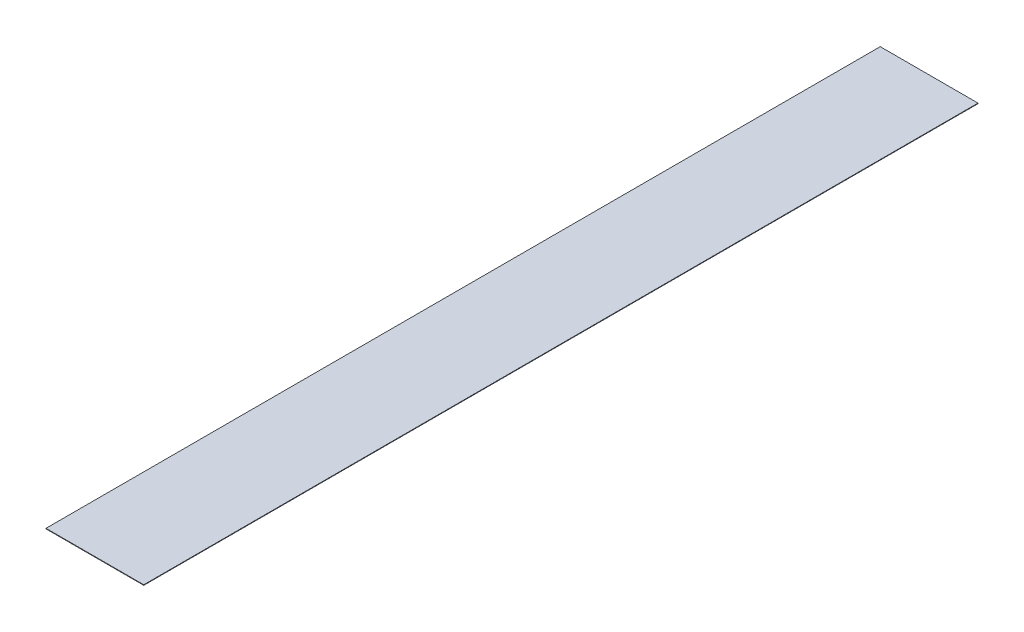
ISO-10303-21;
HEADER;
FILE_DESCRIPTION(('STEP AP214'),'2;1');
FILE_NAME('part.step','',(''),(''),'','','');
FILE_SCHEMA(('AUTOMOTIVE_DESIGN { 1 0 10303 214 1 1 1 1 }'));
ENDSEC;
DATA;
#1=APPLICATION_CONTEXT('core data for automotive mechanical design processes');
#2=APPLICATION_PROTOCOL_DEFINITION('international standard','automotive_design',2000,#1);
#3=PRODUCT_CONTEXT('',#1,'mechanical');
#4=PRODUCT('Part','Part','',(#3));
#5=PRODUCT_RELATED_PRODUCT_CATEGORY('part','',(#4));
#6=PRODUCT_DEFINITION_FORMATION('','',#4);
#7=PRODUCT_DEFINITION_CONTEXT('part definition',#1,'design');
#8=PRODUCT_DEFINITION('design','',#6,#7);
#9=PRODUCT_DEFINITION_SHAPE('','',#8);
#10=(LENGTH_UNIT() NAMED_UNIT(*) SI_UNIT(.MILLI.,.METRE.));
#11=(NAMED_UNIT(*) PLANE_ANGLE_UNIT() SI_UNIT($,.RADIAN.));
#12=(NAMED_UNIT(*) SI_UNIT($,.STERADIAN.) SOLID_ANGLE_UNIT());
#13=UNCERTAINTY_MEASURE_WITH_UNIT(LENGTH_MEASURE(1.E-05),#10,'distance_accuracy_value','');
#14=(GEOMETRIC_REPRESENTATION_CONTEXT(3) GLOBAL_UNCERTAINTY_ASSIGNED_CONTEXT((#13)) GLOBAL_UNIT_ASSIGNED_CONTEXT((#10,
#11,#12)) REPRESENTATION_CONTEXT('',''));
#15=CARTESIAN_POINT('',(0.,0.,0.));
#16=DIRECTION('',(0.,0.,1.));
#17=DIRECTION('',(1.,0.,0.));
#18=AXIS2_PLACEMENT_3D('',#15,#16,#17);
#19=CARTESIAN_POINT('',(23.8125,0.254,203.2));
#20=DIRECTION('',(-1.,0.,0.));
#21=DIRECTION('',(0.,0.,1.));
#22=AXIS2_PLACEMENT_3D('',#19,#20,#21);
#23=PLANE('',#22);
#24=DIRECTION('',(0.,0.,-1.));
#25=VECTOR('',#24,1.);
#26=CARTESIAN_POINT('',(23.8125,0.,203.2));
#27=LINE('',#26,#25);
#28=CARTESIAN_POINT('',(23.8125,0.,203.2));
#29=VERTEX_POINT('',#28);
#30=CARTESIAN_POINT('',(23.8125,0.,-203.2));
#31=VERTEX_POINT('',#30);
#32=EDGE_CURVE('E111',#29,#31,#27,.T.);
#33=ORIENTED_EDGE('',*,*,#32,.T.);
#34=DIRECTION('',(0.,-1.,0.));
#35=VECTOR('',#34,1.);
#36=CARTESIAN_POINT('',(23.8125,0.254,-203.2));
#37=LINE('',#36,#35);
#38=CARTESIAN_POINT('',(23.8125,0.254,-203.2));
#39=VERTEX_POINT('',#38);
#40=EDGE_CURVE('E11',#39,#31,#37,.T.);
#41=ORIENTED_EDGE('',*,*,#40,.F.);
#42=DIRECTION('',(0.,0.,-1.));
#43=VECTOR('',#42,1.);
#44=CARTESIAN_POINT('',(23.8125,0.254,203.2));
#45=LINE('',#44,#43);
#46=CARTESIAN_POINT('',(23.8125,0.254,203.2));
#47=VERTEX_POINT('',#46);
#48=EDGE_CURVE('E95',#47,#39,#45,.T.);
#49=ORIENTED_EDGE('',*,*,#48,.F.);
#50=DIRECTION('',(0.,-1.,0.));
#51=VECTOR('',#50,1.);
#52=CARTESIAN_POINT('',(23.8125,0.254,203.2));
#53=LINE('',#52,#51);
#54=EDGE_CURVE('E107',#47,#29,#53,.T.);
#55=ORIENTED_EDGE('',*,*,#54,.T.);
#56=EDGE_LOOP('',(#33,#41,#49,#55));
#57=FACE_BOUND('',#56,.T.);
#58=ADVANCED_FACE('F43',(#57),#23,.F.);
#59=CARTESIAN_POINT('',(23.8125,0.254,-203.2));
#60=DIRECTION('',(0.,0.,1.));
#61=DIRECTION('',(1.,0.,0.));
#62=AXIS2_PLACEMENT_3D('',#59,#60,#61);
#63=PLANE('',#62);
#64=DIRECTION('',(-1.,0.,0.));
#65=VECTOR('',#64,1.);
#66=CARTESIAN_POINT('',(23.8125,0.,-203.2));
#67=LINE('',#66,#65);
#68=CARTESIAN_POINT('',(-23.8125,0.,-203.2));
#69=VERTEX_POINT('',#68);
#70=EDGE_CURVE('E100',#31,#69,#67,.T.);
#71=ORIENTED_EDGE('',*,*,#70,.T.);
#72=DIRECTION('',(0.,-1.,0.));
#73=VECTOR('',#72,1.);
#74=CARTESIAN_POINT('',(-23.8125,0.254,-203.2));
#75=LINE('',#74,#73);
#76=CARTESIAN_POINT('',(-23.8125,0.254,-203.2));
#77=VERTEX_POINT('',#76);
#78=EDGE_CURVE('E52',#77,#69,#75,.T.);
#79=ORIENTED_EDGE('',*,*,#78,.F.);
#80=DIRECTION('',(-1.,0.,0.));
#81=VECTOR('',#80,1.);
#82=CARTESIAN_POINT('',(23.8125,0.254,-203.2));
#83=LINE('',#82,#81);
#84=EDGE_CURVE('E90',#39,#77,#83,.T.);
#85=ORIENTED_EDGE('',*,*,#84,.F.);
#86=ORIENTED_EDGE('',*,*,#40,.T.);
#87=EDGE_LOOP('',(#71,#79,#85,#86));
#88=FACE_BOUND('',#87,.T.);
#89=ADVANCED_FACE('F99',(#88),#63,.F.);
#90=CARTESIAN_POINT('',(-23.8125,0.254,203.2));
#91=DIRECTION('',(1.,0.,0.));
#92=DIRECTION('',(0.,0.,-1.));
#93=AXIS2_PLACEMENT_3D('',#90,#91,#92);
#94=PLANE('',#93);
#95=DIRECTION('',(0.,0.,1.));
#96=VECTOR('',#95,1.);
#97=CARTESIAN_POINT('',(-23.8125,0.,203.2));
#98=LINE('',#97,#96);
#99=CARTESIAN_POINT('',(-23.8125,0.,203.2));
#100=VERTEX_POINT('',#99);
#101=EDGE_CURVE('E77',#69,#100,#98,.T.);
#102=ORIENTED_EDGE('',*,*,#101,.T.);
#103=DIRECTION('',(0.,-1.,0.));
#104=VECTOR('',#103,1.);
#105=CARTESIAN_POINT('',(-23.8125,0.254,203.2));
#106=LINE('',#105,#104);
#107=CARTESIAN_POINT('',(-23.8125,0.254,203.2));
#108=VERTEX_POINT('',#107);
#109=EDGE_CURVE('E102',#108,#100,#106,.T.);
#110=ORIENTED_EDGE('',*,*,#109,.F.);
#111=DIRECTION('',(0.,0.,1.));
#112=VECTOR('',#111,1.);
#113=CARTESIAN_POINT('',(-23.8125,0.254,203.2));
#114=LINE('',#113,#112);
#115=EDGE_CURVE('E93',#77,#108,#114,.T.);
#116=ORIENTED_EDGE('',*,*,#115,.F.);
#117=ORIENTED_EDGE('',*,*,#78,.T.);
#118=EDGE_LOOP('',(#102,#110,#116,#117));
#119=FACE_BOUND('',#118,.T.);
#120=ADVANCED_FACE('F103',(#119),#94,.F.);
#121=CARTESIAN_POINT('',(23.8125,0.254,203.2));
#122=DIRECTION('',(0.,0.,-1.));
#123=DIRECTION('',(-1.,0.,0.));
#124=AXIS2_PLACEMENT_3D('',#121,#122,#123);
#125=PLANE('',#124);
#126=DIRECTION('',(1.,0.,0.));
#127=VECTOR('',#126,1.);
#128=CARTESIAN_POINT('',(23.8125,0.,203.2));
#129=LINE('',#128,#127);
#130=EDGE_CURVE('E83',#100,#29,#129,.T.);
#131=ORIENTED_EDGE('',*,*,#130,.T.);
#132=ORIENTED_EDGE('',*,*,#54,.F.);
#133=DIRECTION('',(1.,0.,0.));
#134=VECTOR('',#133,1.);
#135=CARTESIAN_POINT('',(23.8125,0.254,203.2));
#136=LINE('',#135,#134);
#137=EDGE_CURVE('E60',#108,#47,#136,.T.);
#138=ORIENTED_EDGE('',*,*,#137,.F.);
#139=ORIENTED_EDGE('',*,*,#109,.T.);
#140=EDGE_LOOP('',(#131,#132,#138,#139));
#141=FACE_BOUND('',#140,.T.);
#142=ADVANCED_FACE('F124',(#141),#125,.F.);
#143=CARTESIAN_POINT('',(0.,0.254,0.));
#144=DIRECTION('',(0.,1.,0.));
#145=DIRECTION('',(0.,0.,1.));
#146=AXIS2_PLACEMENT_3D('',#143,#144,#145);
#147=PLANE('',#146);
#148=ORIENTED_EDGE('',*,*,#48,.T.);
#149=ORIENTED_EDGE('',*,*,#84,.T.);
#150=ORIENTED_EDGE('',*,*,#115,.T.);
#151=ORIENTED_EDGE('',*,*,#137,.T.);
#152=EDGE_LOOP('',(#148,#149,#150,#151));
#153=FACE_BOUND('',#152,.T.);
#154=ADVANCED_FACE('F91',(#153),#147,.T.);
#155=CARTESIAN_POINT('',(0.,0.,0.));
#156=DIRECTION('',(0.,1.,0.));
#157=DIRECTION('',(0.,0.,1.));
#158=AXIS2_PLACEMENT_3D('',#155,#156,#157);
#159=PLANE('',#158);
#160=ORIENTED_EDGE('',*,*,#32,.F.);
#161=ORIENTED_EDGE('',*,*,#130,.F.);
#162=ORIENTED_EDGE('',*,*,#101,.F.);
#163=ORIENTED_EDGE('',*,*,#70,.F.);
#164=EDGE_LOOP('',(#160,#161,#162,#163));
#165=FACE_BOUND('',#164,.T.);
#166=ADVANCED_FACE('F127',(#165),#159,.F.);
#167=CLOSED_SHELL('',(#58,#89,#120,#142,#154,#166));
#168=MANIFOLD_SOLID_BREP('B2',#167);
#169=ADVANCED_BREP_SHAPE_REPRESENTATION('',(#18,#168),#14);
#170=SHAPE_DEFINITION_REPRESENTATION(#9,#169);
ENDSEC;
END-ISO-10303-21;
